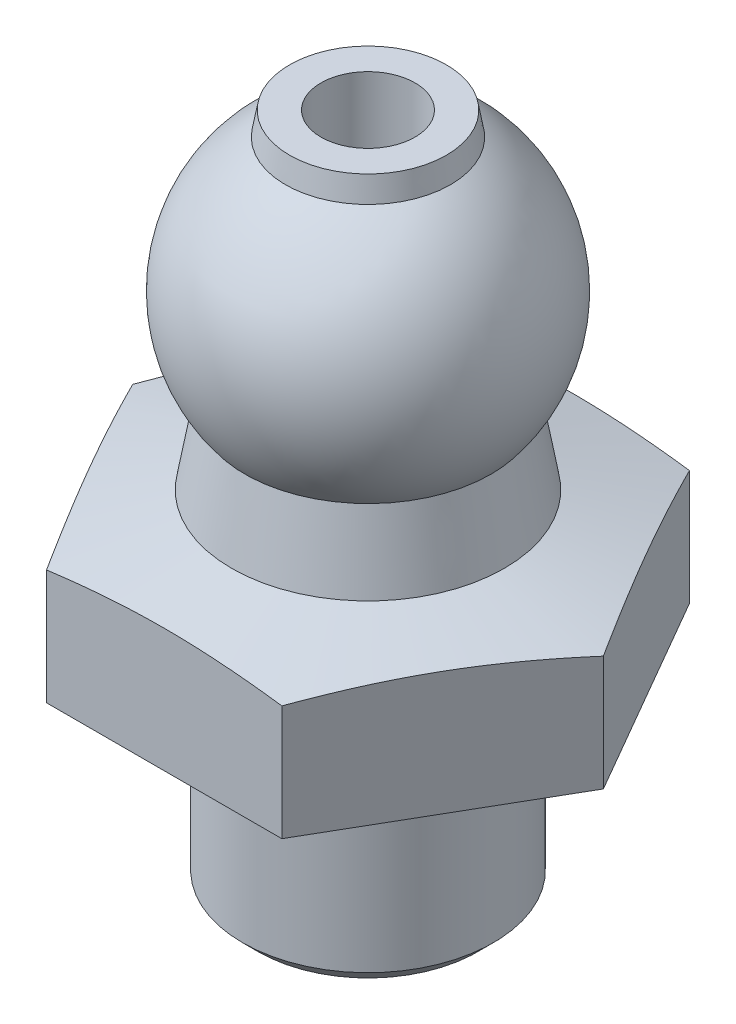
ISO-10303-21;
HEADER;
FILE_DESCRIPTION(('STEP AP214'),'2;1');
FILE_NAME('part.step','',(''),(''),'','','');
FILE_SCHEMA(('AUTOMOTIVE_DESIGN { 1 0 10303 214 1 1 1 1 }'));
ENDSEC;
DATA;
#1=APPLICATION_CONTEXT('core data for automotive mechanical design processes');
#2=APPLICATION_PROTOCOL_DEFINITION('international standard','automotive_design',2000,#1);
#3=PRODUCT_CONTEXT('',#1,'mechanical');
#4=PRODUCT('Part','Part','',(#3));
#5=PRODUCT_RELATED_PRODUCT_CATEGORY('part','',(#4));
#6=PRODUCT_DEFINITION_FORMATION('','',#4);
#7=PRODUCT_DEFINITION_CONTEXT('part definition',#1,'design');
#8=PRODUCT_DEFINITION('design','',#6,#7);
#9=PRODUCT_DEFINITION_SHAPE('','',#8);
#10=(LENGTH_UNIT() NAMED_UNIT(*) SI_UNIT(.MILLI.,.METRE.));
#11=(NAMED_UNIT(*) PLANE_ANGLE_UNIT() SI_UNIT($,.RADIAN.));
#12=(NAMED_UNIT(*) SI_UNIT($,.STERADIAN.) SOLID_ANGLE_UNIT());
#13=UNCERTAINTY_MEASURE_WITH_UNIT(LENGTH_MEASURE(1.E-05),#10,'distance_accuracy_value','');
#14=(GEOMETRIC_REPRESENTATION_CONTEXT(3) GLOBAL_UNCERTAINTY_ASSIGNED_CONTEXT((#13)) GLOBAL_UNIT_ASSIGNED_CONTEXT((#10,
#11,#12)) REPRESENTATION_CONTEXT('',''));
#15=CARTESIAN_POINT('',(0.,0.,0.));
#16=DIRECTION('',(0.,0.,1.));
#17=DIRECTION('',(1.,0.,0.));
#18=AXIS2_PLACEMENT_3D('',#15,#16,#17);
#19=CARTESIAN_POINT('',(4.,0.,0.));
#20=DIRECTION('',(0.,1.,0.));
#21=DIRECTION('',(0.,0.,1.));
#22=AXIS2_PLACEMENT_3D('',#19,#20,#21);
#23=PLANE('',#22);
#24=CARTESIAN_POINT('',(0.,0.,0.));
#25=DIRECTION('',(0.,1.,0.));
#26=DIRECTION('',(0.,0.,1.));
#27=AXIS2_PLACEMENT_3D('',#24,#25,#26);
#28=CIRCLE('',#27,4.);
#29=CARTESIAN_POINT('',(0.,0.,4.));
#30=VERTEX_POINT('',#29);
#31=EDGE_CURVE('E548',#30,#30,#28,.T.);
#32=ORIENTED_EDGE('',*,*,#31,.T.);
#33=EDGE_LOOP('',(#32));
#34=FACE_BOUND('',#33,.T.);
#35=DIRECTION('',(-0.5,0.,-0.866025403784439));
#36=VECTOR('',#35,1.);
#37=CARTESIAN_POINT('',(-7.50555349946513,0.,0.));
#38=LINE('',#37,#36);
#39=CARTESIAN_POINT('',(-3.75277674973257,0.,6.5));
#40=VERTEX_POINT('',#39);
#41=CARTESIAN_POINT('',(-7.50555349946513,0.,0.));
#42=VERTEX_POINT('',#41);
#43=EDGE_CURVE('E521',#40,#42,#38,.T.);
#44=ORIENTED_EDGE('',*,*,#43,.T.);
#45=DIRECTION('',(0.499999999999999,0.,-0.866025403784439));
#46=VECTOR('',#45,1.);
#47=CARTESIAN_POINT('',(-3.75277674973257,0.,-6.5));
#48=LINE('',#47,#46);
#49=CARTESIAN_POINT('',(-3.75277674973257,0.,-6.5));
#50=VERTEX_POINT('',#49);
#51=EDGE_CURVE('E519',#42,#50,#48,.T.);
#52=ORIENTED_EDGE('',*,*,#51,.T.);
#53=DIRECTION('',(1.,0.,0.));
#54=VECTOR('',#53,1.);
#55=CARTESIAN_POINT('',(3.75277674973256,0.,-6.5));
#56=LINE('',#55,#54);
#57=CARTESIAN_POINT('',(3.75277674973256,0.,-6.5));
#58=VERTEX_POINT('',#57);
#59=EDGE_CURVE('E462',#50,#58,#56,.T.);
#60=ORIENTED_EDGE('',*,*,#59,.T.);
#61=DIRECTION('',(0.5,0.,0.866025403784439));
#62=VECTOR('',#61,1.);
#63=CARTESIAN_POINT('',(7.50555349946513,0.,0.));
#64=LINE('',#63,#62);
#65=CARTESIAN_POINT('',(7.50555349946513,0.,0.));
#66=VERTEX_POINT('',#65);
#67=EDGE_CURVE('E509',#58,#66,#64,.T.);
#68=ORIENTED_EDGE('',*,*,#67,.T.);
#69=DIRECTION('',(-0.5,0.,0.866025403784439));
#70=VECTOR('',#69,1.);
#71=CARTESIAN_POINT('',(3.75277674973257,0.,6.5));
#72=LINE('',#71,#70);
#73=CARTESIAN_POINT('',(3.75277674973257,0.,6.5));
#74=VERTEX_POINT('',#73);
#75=EDGE_CURVE('E515',#66,#74,#72,.T.);
#76=ORIENTED_EDGE('',*,*,#75,.T.);
#77=DIRECTION('',(-1.,0.,0.));
#78=VECTOR('',#77,1.);
#79=CARTESIAN_POINT('',(-3.75277674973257,0.,6.5));
#80=LINE('',#79,#78);
#81=EDGE_CURVE('E526',#74,#40,#80,.T.);
#82=ORIENTED_EDGE('',*,*,#81,.T.);
#83=EDGE_LOOP('',(#44,#52,#60,#68,#76,#82));
#84=FACE_BOUND('',#83,.T.);
#85=ADVANCED_FACE('F442',(#34,#84),#23,.F.);
#86=CARTESIAN_POINT('',(0.,3.,0.));
#87=DIRECTION('',(0.,-1.,0.));
#88=DIRECTION('',(0.,0.,-1.));
#89=AXIS2_PLACEMENT_3D('',#86,#87,#88);
#90=CONICAL_SURFACE('',#89,10.,1.30899693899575);
#91=CARTESIAN_POINT('',(0.,4.51419977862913,0.));
#92=DIRECTION('',(0.,1.,0.));
#93=DIRECTION('',(0.,0.,1.));
#94=AXIS2_PLACEMENT_3D('',#91,#92,#93);
#95=CIRCLE('',#94,4.34892949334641);
#96=CARTESIAN_POINT('',(0.,4.51419977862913,4.34892949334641));
#97=VERTEX_POINT('',#96);
#98=EDGE_CURVE('E545',#97,#97,#95,.T.);
#99=ORIENTED_EDGE('',*,*,#98,.F.);
#100=EDGE_LOOP('',(#99));
#101=FACE_BOUND('',#100,.T.);
#102=CARTESIAN_POINT('',(-3.75266127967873,3.66835398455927,6.5002));
#103=CARTESIAN_POINT('',(-3.90851423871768,3.71013238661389,6.23025475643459));
#104=CARTESIAN_POINT('',(-4.06464977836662,3.74806029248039,5.95982006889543));
#105=CARTESIAN_POINT('',(-4.37747226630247,3.81469607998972,5.41799562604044));
#106=CARTESIAN_POINT('',(-4.53415941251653,3.84340021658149,5.14660552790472));
#107=CARTESIAN_POINT('',(-4.84713511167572,3.88991272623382,4.60451571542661));
#108=CARTESIAN_POINT('',(-5.00342154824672,3.90777656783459,4.33381966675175));
#109=CARTESIAN_POINT('',(-5.31619372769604,3.93173015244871,3.79208236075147));
#110=CARTESIAN_POINT('',(-5.47267942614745,3.93782217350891,3.52104118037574));
#111=CARTESIAN_POINT('',(-5.78565082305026,3.93782217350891,2.97895881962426));
#112=CARTESIAN_POINT('',(-5.94213652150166,3.93173015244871,2.70791763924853));
#113=CARTESIAN_POINT('',(-6.25490870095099,3.90777656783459,2.16618033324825));
#114=CARTESIAN_POINT('',(-6.41119513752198,3.88991272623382,1.89548428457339));
#115=CARTESIAN_POINT('',(-6.72417083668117,3.84340021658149,1.35339447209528));
#116=CARTESIAN_POINT('',(-6.88085798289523,3.81469607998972,1.08200437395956));
#117=CARTESIAN_POINT('',(-7.19368047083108,3.74806029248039,0.540179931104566));
#118=CARTESIAN_POINT('',(-7.34981601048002,3.71013238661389,0.269745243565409));
#119=CARTESIAN_POINT('',(-7.50566896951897,3.66835398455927,-0.000199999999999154));
#120=B_SPLINE_CURVE_WITH_KNOTS('',3,(#102,#103,#104,#105,#106,#107,#108,#109,#110,#111,#112,
#113,#114,#115,#116,#117,#118,#119),.UNSPECIFIED.,.F.,.F.,(4,2,2,2,2,2,2,2,4),(0.,
0.943529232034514,1.88744107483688,2.82648138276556,3.76533995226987,4.70419852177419,
5.64323882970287,6.58715067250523,7.53067990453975),.UNSPECIFIED.);
#121=CARTESIAN_POINT('',(-3.75277674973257,3.66838492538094,6.5));
#122=VERTEX_POINT('',#121);
#123=CARTESIAN_POINT('',(-7.50555349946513,3.66838492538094,0.));
#124=VERTEX_POINT('',#123);
#125=EDGE_CURVE('E12',#122,#124,#120,.T.);
#126=ORIENTED_EDGE('',*,*,#125,.F.);
#127=CARTESIAN_POINT('',(-9.92842472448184,2.49976224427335,6.5));
#128=CARTESIAN_POINT('',(-9.63348934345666,2.56586281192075,6.5));
#129=CARTESIAN_POINT('',(-9.3383694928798,2.63115502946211,6.5));
#130=CARTESIAN_POINT('',(-8.74767023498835,2.75968635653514,6.5));
#131=CARTESIAN_POINT('',(-8.45209080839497,2.82292537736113,6.5));
#132=CARTESIAN_POINT('',(-7.86011866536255,2.94696858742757,6.5));
#133=CARTESIAN_POINT('',(-7.56372543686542,3.00777034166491,6.5));
#134=CARTESIAN_POINT('',(-6.97032202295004,3.12628302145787,6.5));
#135=CARTESIAN_POINT('',(-6.67331184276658,3.18399397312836,6.5));
#136=CARTESIAN_POINT('',(-6.08101100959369,3.29513004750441,6.5));
#137=CARTESIAN_POINT('',(-5.7857262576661,3.34858646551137,6.5));
#138=CARTESIAN_POINT('',(-5.1943514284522,3.45083338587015,6.5));
#139=CARTESIAN_POINT('',(-4.89826136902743,3.49962399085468,6.5));
#140=CARTESIAN_POINT('',(-4.30521705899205,3.59144130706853,6.5));
#141=CARTESIAN_POINT('',(-4.00826291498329,3.63446870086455,6.5));
#142=CARTESIAN_POINT('',(-3.41340974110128,3.71349182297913,6.5));
#143=CARTESIAN_POINT('',(-3.11551071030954,3.74948754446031,6.5));
#144=CARTESIAN_POINT('',(-2.51539776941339,3.81342952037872,6.5));
#145=CARTESIAN_POINT('',(-2.21317341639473,3.84127921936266,6.5));
#146=CARTESIAN_POINT('',(-1.60796478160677,3.88700694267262,6.5));
#147=CARTESIAN_POINT('',(-1.30498051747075,3.90488519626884,6.5));
#148=CARTESIAN_POINT('',(-0.698694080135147,3.92962742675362,6.5));
#149=CARTESIAN_POINT('',(-0.395392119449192,3.93649650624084,6.5));
#150=CARTESIAN_POINT('',(0.211255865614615,3.93879843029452,6.5));
#151=CARTESIAN_POINT('',(0.514601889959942,3.93423128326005,6.5));
#152=CARTESIAN_POINT('',(1.12207700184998,3.91391545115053,6.5));
#153=CARTESIAN_POINT('',(1.42620462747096,3.89812392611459,6.5));
#154=CARTESIAN_POINT('',(2.03374475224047,3.85625853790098,6.5));
#155=CARTESIAN_POINT('',(2.33715723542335,3.83018444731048,6.5));
#156=CARTESIAN_POINT('',(2.94326767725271,3.76907131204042,6.5));
#157=CARTESIAN_POINT('',(3.24596502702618,3.73402632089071,6.5));
#158=CARTESIAN_POINT('',(3.85038491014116,3.65643023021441,6.5));
#159=CARTESIAN_POINT('',(4.1521074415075,3.61387911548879,6.5));
#160=CARTESIAN_POINT('',(4.74937869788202,3.52342564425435,6.5));
#161=CARTESIAN_POINT('',(5.04494360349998,3.47562911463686,6.5));
#162=CARTESIAN_POINT('',(5.63525848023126,3.37522032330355,6.5));
#163=CARTESIAN_POINT('',(5.93000842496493,3.32260790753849,6.5));
#164=CARTESIAN_POINT('',(6.51881523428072,3.21348987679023,6.5));
#165=CARTESIAN_POINT('',(6.81287202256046,3.15698385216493,6.5));
#166=CARTESIAN_POINT('',(7.4003644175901,3.04082214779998,6.5));
#167=CARTESIAN_POINT('',(7.69380001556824,2.98116642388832,6.5));
#168=CARTESIAN_POINT('',(8.5734797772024,2.79836295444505,6.5));
#169=CARTESIAN_POINT('',(9.15893219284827,2.67141017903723,6.5));
#170=CARTESIAN_POINT('',(10.328272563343,2.41074645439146,6.5));
#171=CARTESIAN_POINT('',(10.9121606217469,2.27703596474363,6.5));
#172=CARTESIAN_POINT('',(12.0725338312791,2.00638342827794,6.5));
#173=CARTESIAN_POINT('',(12.6490308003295,1.86949191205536,6.5));
#174=CARTESIAN_POINT('',(13.8012419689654,1.59241085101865,6.5));
#175=CARTESIAN_POINT('',(14.376956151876,1.45222123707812,6.5));
#176=CARTESIAN_POINT('',(15.5270135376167,1.16961610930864,6.5));
#177=CARTESIAN_POINT('',(16.1013575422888,1.02720385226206,6.5));
#178=CARTESIAN_POINT('',(17.2495631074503,0.740531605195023,6.5));
#179=CARTESIAN_POINT('',(17.8234246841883,0.596271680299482,6.5));
#180=CARTESIAN_POINT('',(18.3971206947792,0.451364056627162,6.5));
#181=B_SPLINE_CURVE_WITH_KNOTS('',3,(#127,#128,#129,#130,#131,#132,#133,#134,#135,#136,#137,
#138,#139,#140,#141,#142,#143,#144,#145,#146,#147,#148,#149,#150,#151,#152,#153,#154,#155,#156,
#157,#158,#159,#160,#161,#162,#163,#164,#165,#166,#167,#168,#169,#170,#171,#172,#173,#174,#175,
#176,#177,#178,#179,#180),.UNSPECIFIED.,.F.,.F.,(4,2,2,2,2,2,2,2,2,2,2,2,2,2,2,2,2,2,2,2,2,2,2,
2,2,2,4),(0.,0.906759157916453,1.81355743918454,2.72124017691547,3.62891524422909,
4.52913867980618,5.42934230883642,6.32943922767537,7.22953702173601,8.13990744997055,
9.05025694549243,9.96018438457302,10.8701111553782,11.7835296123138,12.6969682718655,
13.6110139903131,14.5250615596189,15.4232271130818,16.3214214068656,17.219710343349,
18.1180118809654,19.9151178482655,21.7121017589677,23.4896683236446,25.2672721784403,
27.0424787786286,28.8176229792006),.UNSPECIFIED.);
#182=CARTESIAN_POINT('',(3.75277674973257,3.66838492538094,6.5));
#183=VERTEX_POINT('',#182);
#184=EDGE_CURVE('E455',#183,#122,#181,.F.);
#185=ORIENTED_EDGE('',*,*,#184,.F.);
#186=CARTESIAN_POINT('',(7.50566896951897,3.66835398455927,-0.0002));
#187=CARTESIAN_POINT('',(7.34981601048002,3.71013238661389,0.269745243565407));
#188=CARTESIAN_POINT('',(7.19368047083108,3.74806029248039,0.540179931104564));
#189=CARTESIAN_POINT('',(6.88085798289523,3.81469607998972,1.08200437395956));
#190=CARTESIAN_POINT('',(6.72417083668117,3.84340021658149,1.35339447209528));
#191=CARTESIAN_POINT('',(6.41119513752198,3.88991272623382,1.89548428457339));
#192=CARTESIAN_POINT('',(6.25490870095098,3.90777656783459,2.16618033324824));
#193=CARTESIAN_POINT('',(5.94213652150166,3.93173015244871,2.70791763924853));
#194=CARTESIAN_POINT('',(5.78565082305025,3.93782217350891,2.97895881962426));
#195=CARTESIAN_POINT('',(5.47267942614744,3.93782217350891,3.52104118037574));
#196=CARTESIAN_POINT('',(5.31619372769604,3.93173015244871,3.79208236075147));
#197=CARTESIAN_POINT('',(5.00342154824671,3.90777656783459,4.33381966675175));
#198=CARTESIAN_POINT('',(4.84713511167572,3.88991272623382,4.60451571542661));
#199=CARTESIAN_POINT('',(4.53415941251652,3.84340021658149,5.14660552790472));
#200=CARTESIAN_POINT('',(4.37747226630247,3.81469607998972,5.41799562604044));
#201=CARTESIAN_POINT('',(4.06464977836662,3.74806029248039,5.95982006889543));
#202=CARTESIAN_POINT('',(3.90851423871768,3.71013238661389,6.23025475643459));
#203=CARTESIAN_POINT('',(3.75266127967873,3.66835398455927,6.5002));
#204=B_SPLINE_CURVE_WITH_KNOTS('',3,(#186,#187,#188,#189,#190,#191,#192,#193,#194,#195,#196,
#197,#198,#199,#200,#201,#202,#203),.UNSPECIFIED.,.F.,.F.,(4,2,2,2,2,2,2,2,4),(0.,
0.943529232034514,1.88744107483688,2.82648138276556,3.76533995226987,4.70419852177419,
5.64323882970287,6.58715067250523,7.53067990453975),.UNSPECIFIED.);
#205=CARTESIAN_POINT('',(7.50555349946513,3.66838492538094,0.));
#206=VERTEX_POINT('',#205);
#207=EDGE_CURVE('E711',#206,#183,#204,.T.);
#208=ORIENTED_EDGE('',*,*,#207,.F.);
#209=CARTESIAN_POINT('',(3.75266127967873,3.66835398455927,-6.5002));
#210=CARTESIAN_POINT('',(3.90851423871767,3.71013238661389,-6.23025475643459));
#211=CARTESIAN_POINT('',(4.06464977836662,3.74806029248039,-5.95982006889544));
#212=CARTESIAN_POINT('',(4.37747226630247,3.81469607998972,-5.41799562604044));
#213=CARTESIAN_POINT('',(4.53415941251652,3.84340021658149,-5.14660552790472));
#214=CARTESIAN_POINT('',(4.84713511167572,3.88991272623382,-4.60451571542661));
#215=CARTESIAN_POINT('',(5.00342154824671,3.90777656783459,-4.33381966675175));
#216=CARTESIAN_POINT('',(5.31619372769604,3.93173015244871,-3.79208236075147));
#217=CARTESIAN_POINT('',(5.47267942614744,3.93782217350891,-3.52104118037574));
#218=CARTESIAN_POINT('',(5.78565082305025,3.93782217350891,-2.97895881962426));
#219=CARTESIAN_POINT('',(5.94213652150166,3.93173015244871,-2.70791763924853));
#220=CARTESIAN_POINT('',(6.25490870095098,3.90777656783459,-2.16618033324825));
#221=CARTESIAN_POINT('',(6.41119513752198,3.88991272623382,-1.89548428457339));
#222=CARTESIAN_POINT('',(6.72417083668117,3.84340021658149,-1.35339447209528));
#223=CARTESIAN_POINT('',(6.88085798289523,3.81469607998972,-1.08200437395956));
#224=CARTESIAN_POINT('',(7.19368047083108,3.74806029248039,-0.540179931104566));
#225=CARTESIAN_POINT('',(7.34981601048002,3.71013238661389,-0.269745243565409));
#226=CARTESIAN_POINT('',(7.50566896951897,3.66835398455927,0.000199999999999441));
#227=B_SPLINE_CURVE_WITH_KNOTS('',3,(#209,#210,#211,#212,#213,#214,#215,#216,#217,#218,#219,
#220,#221,#222,#223,#224,#225,#226),.UNSPECIFIED.,.F.,.F.,(4,2,2,2,2,2,2,2,4),(0.,
0.943529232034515,1.88744107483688,2.82648138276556,3.76533995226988,4.70419852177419,
5.64323882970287,6.58715067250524,7.53067990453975),.UNSPECIFIED.);
#228=CARTESIAN_POINT('',(3.75277674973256,3.66838492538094,-6.5));
#229=VERTEX_POINT('',#228);
#230=EDGE_CURVE('E706',#229,#206,#227,.T.);
#231=ORIENTED_EDGE('',*,*,#230,.F.);
#232=CARTESIAN_POINT('',(-9.92842472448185,2.49976224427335,-6.5));
#233=CARTESIAN_POINT('',(-9.63348934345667,2.56586281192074,-6.5));
#234=CARTESIAN_POINT('',(-9.3383694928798,2.63115502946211,-6.5));
#235=CARTESIAN_POINT('',(-8.74767023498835,2.75968635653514,-6.5));
#236=CARTESIAN_POINT('',(-8.45209080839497,2.82292537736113,-6.5));
#237=CARTESIAN_POINT('',(-7.86011866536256,2.94696858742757,-6.5));
#238=CARTESIAN_POINT('',(-7.56372543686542,3.0077703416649,-6.5));
#239=CARTESIAN_POINT('',(-6.97032202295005,3.12628302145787,-6.5));
#240=CARTESIAN_POINT('',(-6.67331184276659,3.18399397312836,-6.5));
#241=CARTESIAN_POINT('',(-6.08101100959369,3.29513004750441,-6.5));
#242=CARTESIAN_POINT('',(-5.78572625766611,3.34858646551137,-6.5));
#243=CARTESIAN_POINT('',(-5.19435142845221,3.45083338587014,-6.5));
#244=CARTESIAN_POINT('',(-4.89826136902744,3.49962399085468,-6.5));
#245=CARTESIAN_POINT('',(-4.30521705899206,3.59144130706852,-6.5));
#246=CARTESIAN_POINT('',(-4.0082629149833,3.63446870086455,-6.5));
#247=CARTESIAN_POINT('',(-3.41340974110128,3.71349182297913,-6.5));
#248=CARTESIAN_POINT('',(-3.11551071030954,3.74948754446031,-6.5));
#249=CARTESIAN_POINT('',(-2.51539776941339,3.81342952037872,-6.5));
#250=CARTESIAN_POINT('',(-2.21317341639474,3.84127921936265,-6.5));
#251=CARTESIAN_POINT('',(-1.60796478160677,3.88700694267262,-6.5));
#252=CARTESIAN_POINT('',(-1.30498051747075,3.90488519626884,-6.5));
#253=CARTESIAN_POINT('',(-0.698694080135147,3.92962742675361,-6.5));
#254=CARTESIAN_POINT('',(-0.395392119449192,3.93649650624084,-6.5));
#255=CARTESIAN_POINT('',(0.211255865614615,3.93879843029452,-6.5));
#256=CARTESIAN_POINT('',(0.514601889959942,3.93423128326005,-6.5));
#257=CARTESIAN_POINT('',(1.12207700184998,3.91391545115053,-6.5));
#258=CARTESIAN_POINT('',(1.42620462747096,3.89812392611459,-6.5));
#259=CARTESIAN_POINT('',(2.03374475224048,3.85625853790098,-6.5));
#260=CARTESIAN_POINT('',(2.33715723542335,3.83018444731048,-6.5));
#261=CARTESIAN_POINT('',(2.94326767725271,3.76907131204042,-6.5));
#262=CARTESIAN_POINT('',(3.24596502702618,3.73402632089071,-6.5));
#263=CARTESIAN_POINT('',(3.85038491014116,3.65643023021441,-6.5));
#264=CARTESIAN_POINT('',(4.1521074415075,3.61387911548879,-6.5));
#265=CARTESIAN_POINT('',(4.74937869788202,3.52342564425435,-6.5));
#266=CARTESIAN_POINT('',(5.04494360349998,3.47562911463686,-6.5));
#267=CARTESIAN_POINT('',(5.63525848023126,3.37522032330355,-6.5));
#268=CARTESIAN_POINT('',(5.93000842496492,3.32260790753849,-6.5));
#269=CARTESIAN_POINT('',(6.51881523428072,3.21348987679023,-6.5));
#270=CARTESIAN_POINT('',(6.81287202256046,3.15698385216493,-6.5));
#271=CARTESIAN_POINT('',(7.40036441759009,3.04082214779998,-6.5));
#272=CARTESIAN_POINT('',(7.69380001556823,2.98116642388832,-6.5));
#273=CARTESIAN_POINT('',(8.57347977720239,2.79836295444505,-6.5));
#274=CARTESIAN_POINT('',(9.15893219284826,2.67141017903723,-6.5));
#275=CARTESIAN_POINT('',(10.328272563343,2.41074645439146,-6.5));
#276=CARTESIAN_POINT('',(10.9121606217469,2.27703596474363,-6.5));
#277=CARTESIAN_POINT('',(12.072533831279,2.00638342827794,-6.5));
#278=CARTESIAN_POINT('',(12.6490308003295,1.86949191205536,-6.5));
#279=CARTESIAN_POINT('',(13.8012419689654,1.59241085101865,-6.5));
#280=CARTESIAN_POINT('',(14.376956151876,1.45222123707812,-6.5));
#281=CARTESIAN_POINT('',(15.5270135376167,1.16961610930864,-6.5));
#282=CARTESIAN_POINT('',(16.1013575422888,1.02720385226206,-6.5));
#283=CARTESIAN_POINT('',(17.2495631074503,0.740531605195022,-6.5));
#284=CARTESIAN_POINT('',(17.8234246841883,0.596271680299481,-6.5));
#285=CARTESIAN_POINT('',(18.3971206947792,0.451364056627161,-6.5));
#286=B_SPLINE_CURVE_WITH_KNOTS('',3,(#232,#233,#234,#235,#236,#237,#238,#239,#240,#241,#242,
#243,#244,#245,#246,#247,#248,#249,#250,#251,#252,#253,#254,#255,#256,#257,#258,#259,#260,#261,
#262,#263,#264,#265,#266,#267,#268,#269,#270,#271,#272,#273,#274,#275,#276,#277,#278,#279,#280,
#281,#282,#283,#284,#285),.UNSPECIFIED.,.F.,.F.,(4,2,2,2,2,2,2,2,2,2,2,2,2,2,2,2,2,2,2,2,2,2,2,
2,2,2,4),(0.,0.906759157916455,1.81355743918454,2.72124017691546,3.62891524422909,
4.52913867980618,5.42934230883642,6.32943922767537,7.22953702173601,8.13990744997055,
9.05025694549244,9.96018438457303,10.8701111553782,11.7835296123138,12.6969682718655,
13.6110139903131,14.5250615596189,15.4232271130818,16.3214214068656,17.219710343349,
18.1180118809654,19.9151178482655,21.7121017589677,23.4896683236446,25.2672721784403,
27.0424787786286,28.8176229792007),.UNSPECIFIED.);
#287=CARTESIAN_POINT('',(-3.75277674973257,3.66838492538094,-6.5));
#288=VERTEX_POINT('',#287);
#289=EDGE_CURVE('E502',#288,#229,#286,.T.);
#290=ORIENTED_EDGE('',*,*,#289,.F.);
#291=CARTESIAN_POINT('',(-7.50566896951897,3.66835398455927,0.000200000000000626));
#292=CARTESIAN_POINT('',(-7.34981601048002,3.71013238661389,-0.269745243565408));
#293=CARTESIAN_POINT('',(-7.19368047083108,3.74806029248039,-0.540179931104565));
#294=CARTESIAN_POINT('',(-6.88085798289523,3.81469607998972,-1.08200437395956));
#295=CARTESIAN_POINT('',(-6.72417083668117,3.84340021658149,-1.35339447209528));
#296=CARTESIAN_POINT('',(-6.41119513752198,3.88991272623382,-1.89548428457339));
#297=CARTESIAN_POINT('',(-6.25490870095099,3.90777656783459,-2.16618033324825));
#298=CARTESIAN_POINT('',(-5.94213652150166,3.93173015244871,-2.70791763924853));
#299=CARTESIAN_POINT('',(-5.78565082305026,3.9378221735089,-2.97895881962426));
#300=CARTESIAN_POINT('',(-5.47267942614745,3.9378221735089,-3.52104118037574));
#301=CARTESIAN_POINT('',(-5.31619372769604,3.93173015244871,-3.79208236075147));
#302=CARTESIAN_POINT('',(-5.00342154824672,3.90777656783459,-4.33381966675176));
#303=CARTESIAN_POINT('',(-4.84713511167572,3.88991272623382,-4.60451571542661));
#304=CARTESIAN_POINT('',(-4.53415941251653,3.84340021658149,-5.14660552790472));
#305=CARTESIAN_POINT('',(-4.37747226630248,3.81469607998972,-5.41799562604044));
#306=CARTESIAN_POINT('',(-4.06464977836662,3.74806029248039,-5.95982006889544));
#307=CARTESIAN_POINT('',(-3.90851423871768,3.71013238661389,-6.23025475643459));
#308=CARTESIAN_POINT('',(-3.75266127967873,3.66835398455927,-6.5002));
#309=B_SPLINE_CURVE_WITH_KNOTS('',3,(#291,#292,#293,#294,#295,#296,#297,#298,#299,#300,#301,
#302,#303,#304,#305,#306,#307,#308),.UNSPECIFIED.,.F.,.F.,(4,2,2,2,2,2,2,2,4),(0.,
0.943529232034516,1.88744107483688,2.82648138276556,3.76533995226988,4.70419852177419,
5.64323882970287,6.58715067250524,7.53067990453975),.UNSPECIFIED.);
#310=EDGE_CURVE('E563',#124,#288,#309,.T.);
#311=ORIENTED_EDGE('',*,*,#310,.F.);
#312=EDGE_LOOP('',(#126,#185,#208,#231,#290,#311));
#313=FACE_BOUND('',#312,.T.);
#314=ADVANCED_FACE('F574',(#101,#313),#90,.T.);
#315=CARTESIAN_POINT('',(2.5,15.,0.));
#316=DIRECTION('',(0.,-1.,0.));
#317=DIRECTION('',(0.,0.,-1.));
#318=AXIS2_PLACEMENT_3D('',#315,#316,#317);
#319=PLANE('',#318);
#320=CARTESIAN_POINT('',(0.,15.,0.));
#321=DIRECTION('',(0.,1.,0.));
#322=DIRECTION('',(0.,0.,1.));
#323=AXIS2_PLACEMENT_3D('',#320,#321,#322);
#324=CIRCLE('',#323,1.5);
#325=CARTESIAN_POINT('',(0.,15.,1.5));
#326=VERTEX_POINT('',#325);
#327=EDGE_CURVE('E560',#326,#326,#324,.T.);
#328=ORIENTED_EDGE('',*,*,#327,.F.);
#329=EDGE_LOOP('',(#328));
#330=FACE_BOUND('',#329,.T.);
#331=CARTESIAN_POINT('',(0.,15.,0.));
#332=DIRECTION('',(0.,1.,0.));
#333=DIRECTION('',(0.,0.,1.));
#334=AXIS2_PLACEMENT_3D('',#331,#332,#333);
#335=CIRCLE('',#334,2.5);
#336=CARTESIAN_POINT('',(0.,15.,2.5));
#337=VERTEX_POINT('',#336);
#338=EDGE_CURVE('E531',#337,#337,#335,.T.);
#339=ORIENTED_EDGE('',*,*,#338,.T.);
#340=EDGE_LOOP('',(#339));
#341=FACE_BOUND('',#340,.T.);
#342=ADVANCED_FACE('F444',(#330,#341),#319,.F.);
#343=CARTESIAN_POINT('',(0.,24.8762886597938,0.));
#344=DIRECTION('',(0.,1.,0.));
#345=DIRECTION('',(0.,0.,1.));
#346=AXIS2_PLACEMENT_3D('',#343,#344,#345);
#347=CYLINDRICAL_SURFACE('',#346,1.5);
#348=CARTESIAN_POINT('',(0.,-6.5,0.));
#349=DIRECTION('',(0.,1.,0.));
#350=DIRECTION('',(0.,0.,1.));
#351=AXIS2_PLACEMENT_3D('',#348,#349,#350);
#352=CIRCLE('',#351,1.5);
#353=CARTESIAN_POINT('',(0.,-6.5,1.5));
#354=VERTEX_POINT('',#353);
#355=EDGE_CURVE('E557',#354,#354,#352,.T.);
#356=ORIENTED_EDGE('',*,*,#355,.F.);
#357=EDGE_LOOP('',(#356));
#358=FACE_BOUND('',#357,.T.);
#359=ORIENTED_EDGE('',*,*,#327,.T.);
#360=EDGE_LOOP('',(#359));
#361=FACE_BOUND('',#360,.T.);
#362=ADVANCED_FACE('F620',(#358,#361),#347,.F.);
#363=CARTESIAN_POINT('',(1.5,-6.5,0.));
#364=DIRECTION('',(0.,1.,0.));
#365=DIRECTION('',(0.,0.,1.));
#366=AXIS2_PLACEMENT_3D('',#363,#364,#365);
#367=PLANE('',#366);
#368=CARTESIAN_POINT('',(0.,-6.5,0.));
#369=DIRECTION('',(0.,1.,0.));
#370=DIRECTION('',(0.,0.,1.));
#371=AXIS2_PLACEMENT_3D('',#368,#369,#370);
#372=CIRCLE('',#371,3.5);
#373=CARTESIAN_POINT('',(0.,-6.5,3.5));
#374=VERTEX_POINT('',#373);
#375=EDGE_CURVE('E554',#374,#374,#372,.T.);
#376=ORIENTED_EDGE('',*,*,#375,.F.);
#377=EDGE_LOOP('',(#376));
#378=FACE_BOUND('',#377,.T.);
#379=ORIENTED_EDGE('',*,*,#355,.T.);
#380=EDGE_LOOP('',(#379));
#381=FACE_BOUND('',#380,.T.);
#382=ADVANCED_FACE('F617',(#378,#381),#367,.F.);
#383=CARTESIAN_POINT('',(0.,-6.5,0.));
#384=DIRECTION('',(0.,1.,0.));
#385=DIRECTION('',(0.,0.,1.));
#386=AXIS2_PLACEMENT_3D('',#383,#384,#385);
#387=CONICAL_SURFACE('',#386,3.5,0.785398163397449);
#388=CARTESIAN_POINT('',(0.,-6.,0.));
#389=DIRECTION('',(0.,1.,0.));
#390=DIRECTION('',(0.,0.,1.));
#391=AXIS2_PLACEMENT_3D('',#388,#389,#390);
#392=CIRCLE('',#391,4.);
#393=CARTESIAN_POINT('',(0.,-6.,4.));
#394=VERTEX_POINT('',#393);
#395=EDGE_CURVE('E551',#394,#394,#392,.T.);
#396=ORIENTED_EDGE('',*,*,#395,.F.);
#397=EDGE_LOOP('',(#396));
#398=FACE_BOUND('',#397,.T.);
#399=ORIENTED_EDGE('',*,*,#375,.T.);
#400=EDGE_LOOP('',(#399));
#401=FACE_BOUND('',#400,.T.);
#402=ADVANCED_FACE('F603',(#398,#401),#387,.T.);
#403=CARTESIAN_POINT('',(0.,24.8762886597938,0.));
#404=DIRECTION('',(0.,1.,0.));
#405=DIRECTION('',(0.,0.,1.));
#406=AXIS2_PLACEMENT_3D('',#403,#404,#405);
#407=CYLINDRICAL_SURFACE('',#406,4.);
#408=ORIENTED_EDGE('',*,*,#31,.F.);
#409=EDGE_LOOP('',(#408));
#410=FACE_BOUND('',#409,.T.);
#411=ORIENTED_EDGE('',*,*,#395,.T.);
#412=EDGE_LOOP('',(#411));
#413=FACE_BOUND('',#412,.T.);
#414=ADVANCED_FACE('F598',(#410,#413),#407,.T.);
#415=CARTESIAN_POINT('',(0.,4.51419977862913,0.));
#416=DIRECTION('',(0.,-1.,0.));
#417=DIRECTION('',(0.,0.,-1.));
#418=AXIS2_PLACEMENT_3D('',#415,#416,#417);
#419=CONICAL_SURFACE('',#418,4.34892949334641,0.174532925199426);
#420=CARTESIAN_POINT('',(0.,6.9054271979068,0.));
#421=DIRECTION('',(0.,1.,0.));
#422=DIRECTION('',(0.,0.,1.));
#423=AXIS2_PLACEMENT_3D('',#420,#421,#422);
#424=CIRCLE('',#423,3.9272915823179);
#425=CARTESIAN_POINT('',(3.9272915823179,6.9054271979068,0.));
#426=VERTEX_POINT('',#425);
#427=EDGE_CURVE('E542',#426,#426,#424,.T.);
#428=ORIENTED_EDGE('',*,*,#427,.F.);
#429=EDGE_LOOP('',(#428));
#430=FACE_BOUND('',#429,.T.);
#431=ORIENTED_EDGE('',*,*,#98,.T.);
#432=EDGE_LOOP('',(#431));
#433=FACE_BOUND('',#432,.T.);
#434=ADVANCED_FACE('F595',(#430,#433),#419,.T.);
#435=CARTESIAN_POINT('',(0.,10.,0.));
#436=DIRECTION('',(0.,1.,0.));
#437=DIRECTION('',(1.,0.,0.));
#438=AXIS2_PLACEMENT_3D('',#435,#436,#437);
#439=SPHERICAL_SURFACE('',#438,5.);
#440=CARTESIAN_POINT('',(0.,14.2511600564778,0.));
#441=DIRECTION('',(0.,1.,0.));
#442=DIRECTION('',(0.,0.,1.));
#443=AXIS2_PLACEMENT_3D('',#440,#441,#442);
#444=CIRCLE('',#443,2.63204068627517);
#445=CARTESIAN_POINT('',(2.63204068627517,14.2511600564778,0.));
#446=VERTEX_POINT('',#445);
#447=EDGE_CURVE('E539',#446,#446,#444,.T.);
#448=CARTESIAN_POINT('',(2.63204068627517,14.2511600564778,0.));
#449=CARTESIAN_POINT('',(2.70660494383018,14.2049974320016,0.));
#450=CARTESIAN_POINT('',(2.77995210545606,14.1568694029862,0.));
#451=CARTESIAN_POINT('',(2.92401495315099,14.0568240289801,0.));
#452=CARTESIAN_POINT('',(2.99473063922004,14.0049066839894,0.));
#453=CARTESIAN_POINT('',(3.13333325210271,13.897424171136,0.));
#454=CARTESIAN_POINT('',(3.20122017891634,13.8418590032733,0.));
#455=CARTESIAN_POINT('',(3.33397777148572,13.7272352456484,0.));
#456=CARTESIAN_POINT('',(3.39884843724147,13.6681766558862,0.));
#457=CARTESIAN_POINT('',(3.52539383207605,13.5467293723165,0.));
#458=CARTESIAN_POINT('',(3.58706856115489,13.4843406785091,0.));
#459=CARTESIAN_POINT('',(3.70705139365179,13.3564059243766,0.));
#460=CARTESIAN_POINT('',(3.76535949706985,13.2908598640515,0.));
#461=CARTESIAN_POINT('',(3.87844767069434,13.1567918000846,0.));
#462=CARTESIAN_POINT('',(3.93322774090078,13.0882697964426,0.));
#463=CARTESIAN_POINT('',(4.03910821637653,12.9484395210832,0.));
#464=CARTESIAN_POINT('',(4.09020862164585,12.8771312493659,0.));
#465=CARTESIAN_POINT('',(4.18858831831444,12.7319258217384,0.));
#466=CARTESIAN_POINT('',(4.23586760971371,12.6580286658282,0.));
#467=CARTESIAN_POINT('',(4.32647420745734,12.5078500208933,0.));
#468=CARTESIAN_POINT('',(4.36980151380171,12.4315685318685,0.));
#469=CARTESIAN_POINT('',(4.45238420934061,12.2768323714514,0.));
#470=CARTESIAN_POINT('',(4.49163959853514,12.1983777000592,0.));
#471=CARTESIAN_POINT('',(4.56596979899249,12.0395123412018,0.));
#472=CARTESIAN_POINT('',(4.60104461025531,11.9591016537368,0.));
#473=CARTESIAN_POINT('',(4.66691656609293,11.7965468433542,0.));
#474=CARTESIAN_POINT('',(4.69771371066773,11.7144027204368,0.));
#475=CARTESIAN_POINT('',(4.75494508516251,11.5486084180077,0.));
#476=CARTESIAN_POINT('',(4.78137931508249,11.464958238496,0.));
#477=CARTESIAN_POINT('',(4.829811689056,11.2963833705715,0.));
#478=CARTESIAN_POINT('',(4.85180983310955,11.2114586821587,0.));
#479=CARTESIAN_POINT('',(4.89130914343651,11.0405698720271,0.));
#480=CARTESIAN_POINT('',(4.90881030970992,10.9546057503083,0.));
#481=CARTESIAN_POINT('',(4.93926722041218,10.7818760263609,0.));
#482=CARTESIAN_POINT('',(4.95222296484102,10.6951104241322,0.));
#483=CARTESIAN_POINT('',(4.9735531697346,10.5210179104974,0.));
#484=CARTESIAN_POINT('',(4.98192763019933,10.4336909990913,0.));
#485=CARTESIAN_POINT('',(4.99407208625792,10.2587175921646,0.));
#486=CARTESIAN_POINT('',(4.99784208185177,10.1710710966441,0.));
#487=CARTESIAN_POINT('',(5.00076717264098,9.99570113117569,0.));
#488=CARTESIAN_POINT('',(4.99992226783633,9.90797766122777,0.));
#489=CARTESIAN_POINT('',(4.99361989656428,9.73269656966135,0.));
#490=CARTESIAN_POINT('',(4.98816243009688,9.64513894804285,0.));
#491=CARTESIAN_POINT('',(4.97265004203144,9.47043191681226,0.));
#492=CARTESIAN_POINT('',(4.9625951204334,9.38328250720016,0.));
#493=CARTESIAN_POINT('',(4.9379156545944,9.20963313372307,0.));
#494=CARTESIAN_POINT('',(4.92329111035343,9.12313316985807,0.));
#495=CARTESIAN_POINT('',(4.88951288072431,8.95102212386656,0.));
#496=CARTESIAN_POINT('',(4.87035919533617,8.86541104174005,0.));
#497=CARTESIAN_POINT('',(4.82757570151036,8.69531473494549,0.));
#498=CARTESIAN_POINT('',(4.8039458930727,8.61082951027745,0.));
#499=CARTESIAN_POINT('',(4.7522755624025,8.4432187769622,0.));
#500=CARTESIAN_POINT('',(4.72423504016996,8.360093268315,0.));
#501=CARTESIAN_POINT('',(4.66382089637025,8.19543206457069,0.));
#502=CARTESIAN_POINT('',(4.63144727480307,8.11389636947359,0.));
#503=CARTESIAN_POINT('',(4.56245655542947,7.952640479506,0.));
#504=CARTESIAN_POINT('',(4.52583945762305,7.87292028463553,0.));
#505=CARTESIAN_POINT('',(4.44846310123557,7.71551609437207,0.));
#506=CARTESIAN_POINT('',(4.40770384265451,7.63783209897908,0.));
#507=CARTESIAN_POINT('',(4.32215614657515,7.48471522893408,0.));
#508=CARTESIAN_POINT('',(4.27736770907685,7.40928235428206,0.));
#509=CARTESIAN_POINT('',(4.18388504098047,7.26087694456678,0.));
#510=CARTESIAN_POINT('',(4.13519081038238,7.18790440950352,0.));
#511=CARTESIAN_POINT('',(4.0340335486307,7.04462011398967,0.));
#512=CARTESIAN_POINT('',(3.9815705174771,6.97430835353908,0.));
#513=CARTESIAN_POINT('',(3.9272915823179,6.9054271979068,0.));
#514=B_SPLINE_CURVE_WITH_KNOTS('',3,(#448,#449,#450,#451,#452,#453,#454,#455,#456,#457,#458,
#459,#460,#461,#462,#463,#464,#465,#466,#467,#468,#469,#470,#471,#472,#473,#474,#475,#476,#477,
#478,#479,#480,#481,#482,#483,#484,#485,#486,#487,#488,#489,#490,#491,#492,#493,#494,#495,#496,
#497,#498,#499,#500,#501,#502,#503,#504,#505,#506,#507,#508,#509,#510,#511,#512,#513),
.UNSPECIFIED.,.F.,.F.,(4,2,2,2,2,2,2,2,2,2,2,2,2,2,2,2,2,2,2,2,2,2,2,2,2,2,2,2,2,2,2,2,4),(0.,
0.263061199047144,0.526122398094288,0.789183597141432,1.05224479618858,1.31530599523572,
1.57836719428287,1.84142839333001,2.10448959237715,2.3675507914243,2.63061199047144,
2.89367318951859,3.15673438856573,3.41979558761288,3.68285678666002,3.94591798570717,
4.20897918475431,4.47204038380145,4.7351015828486,4.99816278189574,5.26122398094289,
5.52428517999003,5.78734637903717,6.05040757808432,6.31346877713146,6.57652997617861,
6.83959117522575,7.1026523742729,7.36571357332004,7.62877477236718,7.89183597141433,
8.15489717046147,8.41795836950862),.UNSPECIFIED.);
#515=EDGE_CURVE('BSEAM592',#446,#426,#514,.T.);
#516=ORIENTED_EDGE('',*,*,#447,.F.);
#517=ORIENTED_EDGE('',*,*,#427,.T.);
#518=ORIENTED_EDGE('',*,*,#515,.T.);
#519=ORIENTED_EDGE('',*,*,#515,.F.);
#520=EDGE_LOOP('',(#516,#518,#517,#519));
#521=FACE_BOUND('',#520,.T.);
#522=ADVANCED_FACE('F592',(#521),#439,.T.);
#523=CARTESIAN_POINT('',(0.,14.2511600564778,0.));
#524=DIRECTION('',(0.,-1.,0.));
#525=DIRECTION('',(0.,0.,-1.));
#526=AXIS2_PLACEMENT_3D('',#523,#524,#525);
#527=CONICAL_SURFACE('',#526,2.63204068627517,0.174532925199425);
#528=ORIENTED_EDGE('',*,*,#338,.F.);
#529=EDGE_LOOP('',(#528));
#530=FACE_BOUND('',#529,.T.);
#531=ORIENTED_EDGE('',*,*,#447,.T.);
#532=EDGE_LOOP('',(#531));
#533=FACE_BOUND('',#532,.T.);
#534=ADVANCED_FACE('F588',(#530,#533),#527,.T.);
#535=CARTESIAN_POINT('',(-7.50555349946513,15.,0.));
#536=DIRECTION('',(-0.866025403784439,0.,0.5));
#537=DIRECTION('',(0.5,0.,0.866025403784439));
#538=AXIS2_PLACEMENT_3D('',#535,#536,#537);
#539=PLANE('',#538);
#540=ORIENTED_EDGE('',*,*,#125,.T.);
#541=DIRECTION('',(0.,-1.,0.));
#542=VECTOR('',#541,1.);
#543=CARTESIAN_POINT('',(-7.50555349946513,15.,0.));
#544=LINE('',#543,#542);
#545=EDGE_CURVE('E470',#124,#42,#544,.T.);
#546=ORIENTED_EDGE('',*,*,#545,.T.);
#547=ORIENTED_EDGE('',*,*,#43,.F.);
#548=DIRECTION('',(0.,-1.,0.));
#549=VECTOR('',#548,1.);
#550=CARTESIAN_POINT('',(-3.75277674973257,15.,6.5));
#551=LINE('',#550,#549);
#552=EDGE_CURVE('E529',#122,#40,#551,.T.);
#553=ORIENTED_EDGE('',*,*,#552,.F.);
#554=EDGE_LOOP('',(#540,#546,#547,#553));
#555=FACE_BOUND('',#554,.T.);
#556=ADVANCED_FACE('F583',(#555),#539,.T.);
#557=CARTESIAN_POINT('',(-3.75277674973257,15.,6.5));
#558=DIRECTION('',(0.,0.,1.));
#559=DIRECTION('',(1.,0.,0.));
#560=AXIS2_PLACEMENT_3D('',#557,#558,#559);
#561=PLANE('',#560);
#562=ORIENTED_EDGE('',*,*,#184,.T.);
#563=ORIENTED_EDGE('',*,*,#552,.T.);
#564=ORIENTED_EDGE('',*,*,#81,.F.);
#565=DIRECTION('',(0.,-1.,0.));
#566=VECTOR('',#565,1.);
#567=CARTESIAN_POINT('',(3.75277674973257,15.,6.5));
#568=LINE('',#567,#566);
#569=EDGE_CURVE('E532',#183,#74,#568,.T.);
#570=ORIENTED_EDGE('',*,*,#569,.F.);
#571=EDGE_LOOP('',(#562,#563,#564,#570));
#572=FACE_BOUND('',#571,.T.);
#573=ADVANCED_FACE('F587',(#572),#561,.T.);
#574=CARTESIAN_POINT('',(3.75277674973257,15.,6.5));
#575=DIRECTION('',(0.866025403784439,0.,0.5));
#576=DIRECTION('',(0.5,0.,-0.866025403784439));
#577=AXIS2_PLACEMENT_3D('',#574,#575,#576);
#578=PLANE('',#577);
#579=ORIENTED_EDGE('',*,*,#207,.T.);
#580=ORIENTED_EDGE('',*,*,#569,.T.);
#581=ORIENTED_EDGE('',*,*,#75,.F.);
#582=DIRECTION('',(0.,-1.,0.));
#583=VECTOR('',#582,1.);
#584=CARTESIAN_POINT('',(7.50555349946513,15.,0.));
#585=LINE('',#584,#583);
#586=EDGE_CURVE('E505',#206,#66,#585,.T.);
#587=ORIENTED_EDGE('',*,*,#586,.F.);
#588=EDGE_LOOP('',(#579,#580,#581,#587));
#589=FACE_BOUND('',#588,.T.);
#590=ADVANCED_FACE('F680',(#589),#578,.T.);
#591=CARTESIAN_POINT('',(7.50555349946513,15.,0.));
#592=DIRECTION('',(0.866025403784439,0.,-0.5));
#593=DIRECTION('',(-0.5,0.,-0.866025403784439));
#594=AXIS2_PLACEMENT_3D('',#591,#592,#593);
#595=PLANE('',#594);
#596=ORIENTED_EDGE('',*,*,#230,.T.);
#597=ORIENTED_EDGE('',*,*,#586,.T.);
#598=ORIENTED_EDGE('',*,*,#67,.F.);
#599=DIRECTION('',(0.,-1.,0.));
#600=VECTOR('',#599,1.);
#601=CARTESIAN_POINT('',(3.75277674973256,15.,-6.5));
#602=LINE('',#601,#600);
#603=EDGE_CURVE('E498',#229,#58,#602,.T.);
#604=ORIENTED_EDGE('',*,*,#603,.F.);
#605=EDGE_LOOP('',(#596,#597,#598,#604));
#606=FACE_BOUND('',#605,.T.);
#607=ADVANCED_FACE('F510',(#606),#595,.T.);
#608=CARTESIAN_POINT('',(3.75277674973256,15.,-6.5));
#609=DIRECTION('',(0.,0.,-1.));
#610=DIRECTION('',(-1.,0.,0.));
#611=AXIS2_PLACEMENT_3D('',#608,#609,#610);
#612=PLANE('',#611);
#613=ORIENTED_EDGE('',*,*,#289,.T.);
#614=ORIENTED_EDGE('',*,*,#603,.T.);
#615=ORIENTED_EDGE('',*,*,#59,.F.);
#616=DIRECTION('',(0.,-1.,0.));
#617=VECTOR('',#616,1.);
#618=CARTESIAN_POINT('',(-3.75277674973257,15.,-6.5));
#619=LINE('',#618,#617);
#620=EDGE_CURVE('E506',#288,#50,#619,.T.);
#621=ORIENTED_EDGE('',*,*,#620,.F.);
#622=EDGE_LOOP('',(#613,#614,#615,#621));
#623=FACE_BOUND('',#622,.T.);
#624=ADVANCED_FACE('F500',(#623),#612,.T.);
#625=CARTESIAN_POINT('',(-3.75277674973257,15.,-6.5));
#626=DIRECTION('',(-0.866025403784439,0.,-0.499999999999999));
#627=DIRECTION('',(-0.5,0.,0.866025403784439));
#628=AXIS2_PLACEMENT_3D('',#625,#626,#627);
#629=PLANE('',#628);
#630=ORIENTED_EDGE('',*,*,#310,.T.);
#631=ORIENTED_EDGE('',*,*,#620,.T.);
#632=ORIENTED_EDGE('',*,*,#51,.F.);
#633=ORIENTED_EDGE('',*,*,#545,.F.);
#634=EDGE_LOOP('',(#630,#631,#632,#633));
#635=FACE_BOUND('',#634,.T.);
#636=ADVANCED_FACE('F578',(#635),#629,.T.);
#637=CLOSED_SHELL('',(#85,#314,#342,#362,#382,#402,#414,#434,#522,#534,#556,#573,#590,#607,#624,#636));
#638=MANIFOLD_SOLID_BREP('B2',#637);
#639=ADVANCED_BREP_SHAPE_REPRESENTATION('',(#18,#638),#14);
#640=SHAPE_DEFINITION_REPRESENTATION(#9,#639);
ENDSEC;
END-ISO-10303-21;
